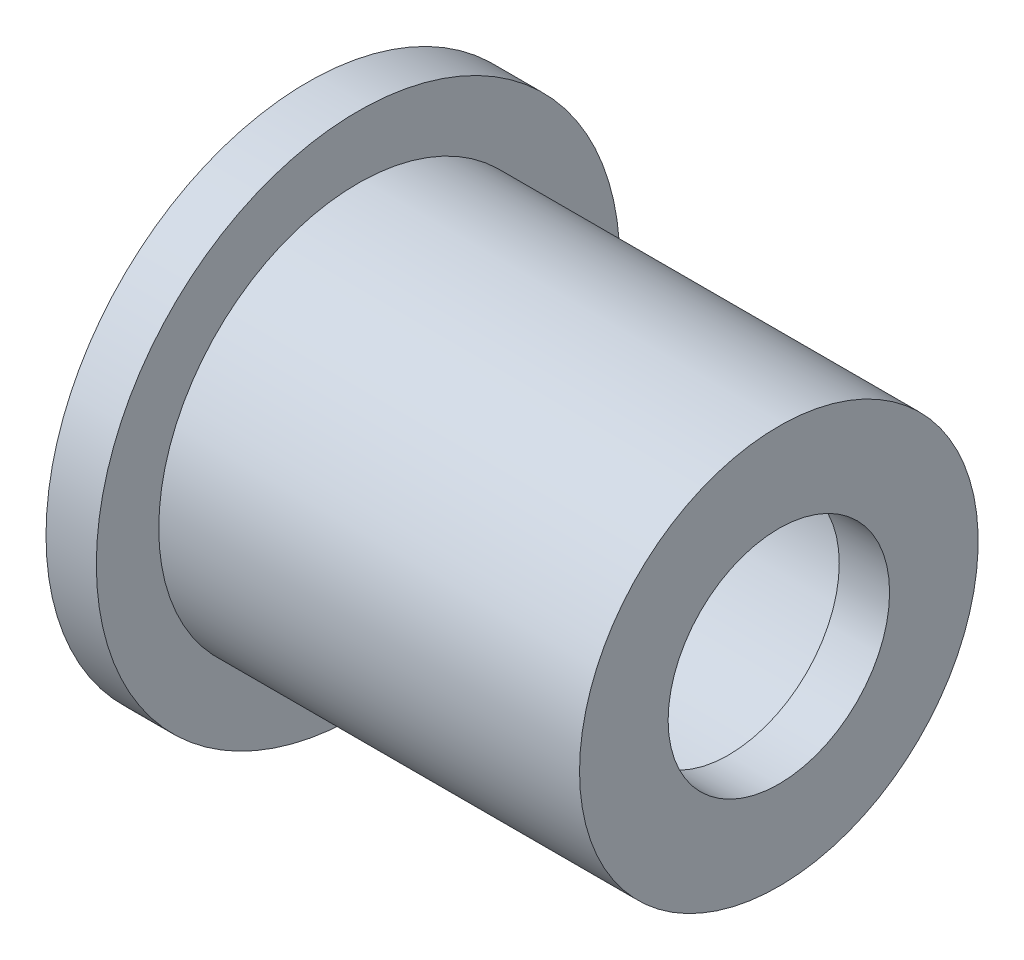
from build123d import *

# Parameters (mm, degrees)
CHANFREIN1_SIZE = 1


with BuildPart() as part:
    # Esquisse1 → Base-R_volution (revolve)
    with BuildSketch(Plane.XY, mode=Mode.PRIVATE) as base_r_volution_sk:
        Polygon((0, 13), (0, 8), (20.9, 8), (20.9, 5.5), (23.4, 5.5), (23.4, 9.9), (2.5, 9.9), (2.5, 13), align=None)
    revolve(base_r_volution_sk.sketch.rotate(Axis((0, 0, 0), (1, 0, 0)), 90), axis=Axis((0, 0, 0), (1, 0, 0)))

    # Chanfrein1
    chanfrein1_edges = [part.edges().sort_by_distance(p)[0] for p in [
        (0, 0, -8),
    ]]
    chamfer(chanfrein1_edges, length=CHANFREIN1_SIZE)


solid = part.part
